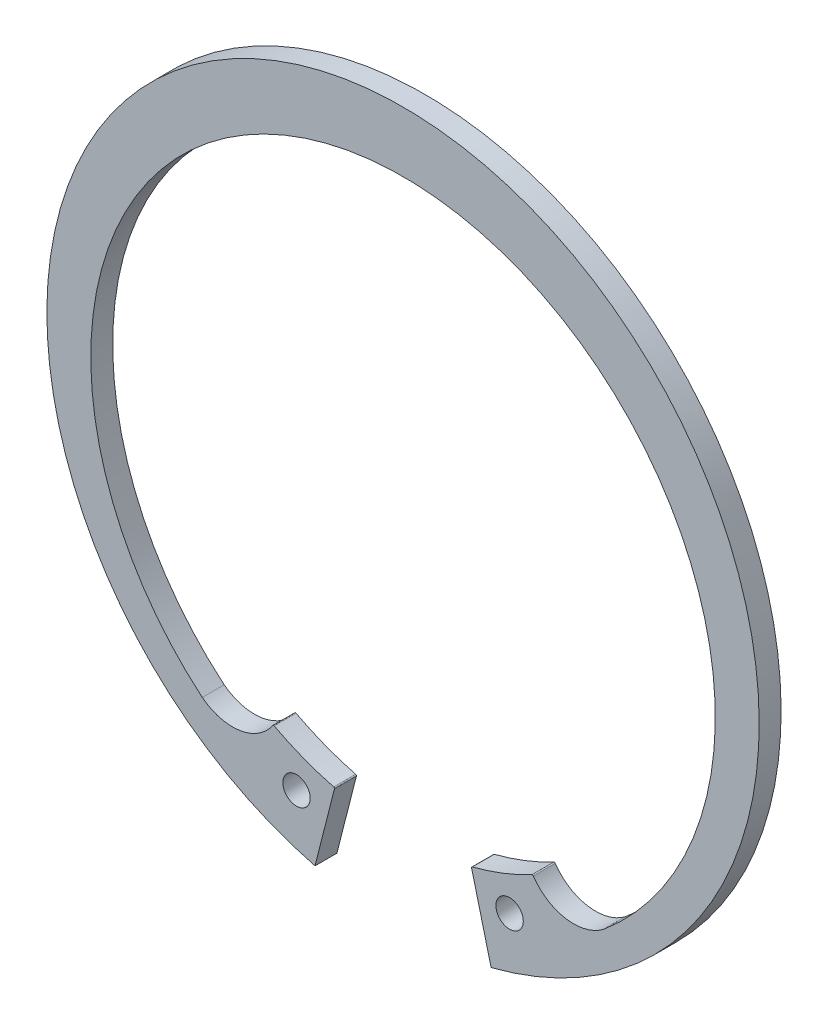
from build123d import *

# Parameters (mm, degrees)
BODYSKE_R    = 1.25
BODY_DEPTH   = 2
MODLUGSKE_R  = 1.25
MODLUG_DEPTH = 2


with BuildPart() as part:
    # BodySke → Body (new body)
    with BuildSketch(Plane.XY):
        with BuildLine():
            Line((8.036769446, -31.490638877), (6.911610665, -27.0819061))
            ThreePointArc((6.911610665, -27.0819061), (8.430607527, -23.767957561), (11.989562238, -24.557544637))
            ThreePointArc((11.989562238, -24.557544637), (13.813954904, -25.616177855), (15.873036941, -25.158691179))
            ThreePointArc((15.873036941, -25.158691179), (0, 27), (-15.873036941, -25.158691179))
            ThreePointArc((-15.873036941, -25.158691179), (-13.813954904, -25.616177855), (-11.989562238, -24.557544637))
            ThreePointArc((-11.989562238, -24.557544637), (-8.430607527, -23.767957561), (-6.911610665, -27.0819061))
            Line((-6.911610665, -27.0819061), (-8.036769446, -31.490638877))
            ThreePointArc((-8.036769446, -31.490638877), (0, 32.5), (8.036769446, -31.490638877))
        make_face()
        with Locations((9.721544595, -26.36477898)):
            Circle(BODYSKE_R, mode=Mode.SUBTRACT)
        with Locations((-9.721544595, -26.36477898)):
            Circle(BODYSKE_R, mode=Mode.SUBTRACT)
    extrude(amount=-BODY_DEPTH)

    # ModLugSke → ModLug (add, through all)
    # profile 1 of 2: a face of its own
    with BuildSketch(Plane.XY):
        with BuildLine():
            Line((8.036769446, -31.490638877), (6.256267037, -24.514059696))
            ThreePointArc((6.256267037, -24.514059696), (6.267060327, -24.438472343), (6.328050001, -24.392535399))
            ThreePointArc((6.328050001, -24.392535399), (9.103202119, -23.498334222), (11.756492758, -22.289568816))
            ThreePointArc((11.756492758, -22.289568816), (11.827301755, -22.280980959), (11.885820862, -22.321763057))
            ThreePointArc((11.885820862, -22.321763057), (14.884950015, -24.216813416), (18.31695521, -23.318296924))
            Line((18.31695521, -23.318296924), (20.076107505, -25.55777587))
            ThreePointArc((20.076107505, -25.55777587), (14.366042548, -29.152475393), (8.036769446, -31.490638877))
        make_face()
        with Locations((9.721544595, -26.36477898)):
            Circle(MODLUGSKE_R, mode=Mode.SUBTRACT)
    # profile 2 of 2: a face of its own
    with BuildSketch(Plane.XY):
        with BuildLine():
            Line((-8.036769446, -31.490638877), (-6.256267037, -24.514059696))
            ThreePointArc((-6.256267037, -24.514059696), (-6.267060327, -24.438472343), (-6.328050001, -24.392535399))
            ThreePointArc((-6.328050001, -24.392535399), (-9.103202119, -23.498334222), (-11.756492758, -22.289568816))
            ThreePointArc((-11.756492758, -22.289568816), (-11.827301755, -22.280980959), (-11.885820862, -22.321763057))
            ThreePointArc((-11.885820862, -22.321763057), (-14.884950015, -24.216813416), (-18.31695521, -23.318296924))
            Line((-18.31695521, -23.318296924), (-20.076107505, -25.55777587))
            ThreePointArc((-20.076107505, -25.55777587), (-14.366042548, -29.152475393), (-8.036769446, -31.490638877))
        make_face()
        with Locations((-9.721544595, -26.36477898)):
            Circle(MODLUGSKE_R, mode=Mode.SUBTRACT)
    extrude(amount=-MODLUG_DEPTH)


solid = part.part
